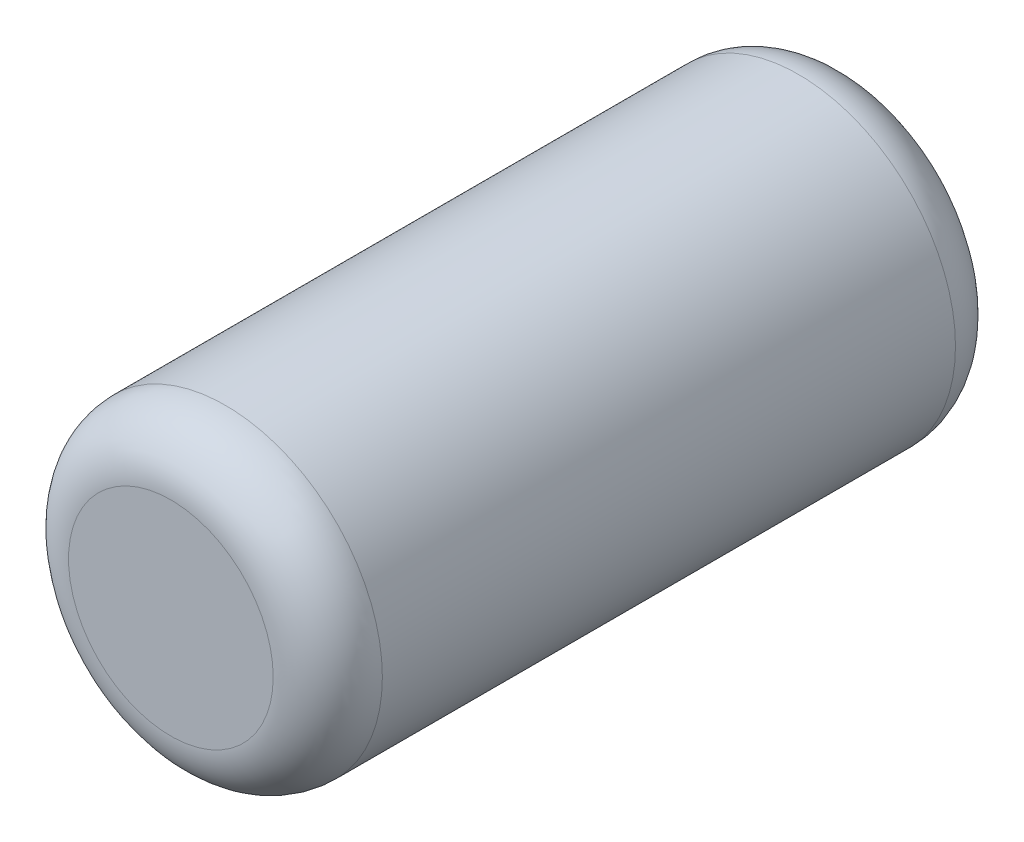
ISO-10303-21;
HEADER;
FILE_DESCRIPTION(('STEP AP214'),'2;1');
FILE_NAME('part.step','',(''),(''),'','','');
FILE_SCHEMA(('AUTOMOTIVE_DESIGN { 1 0 10303 214 1 1 1 1 }'));
ENDSEC;
DATA;
#1=APPLICATION_CONTEXT('core data for automotive mechanical design processes');
#2=APPLICATION_PROTOCOL_DEFINITION('international standard','automotive_design',2000,#1);
#3=PRODUCT_CONTEXT('',#1,'mechanical');
#4=PRODUCT('Part','Part','',(#3));
#5=PRODUCT_RELATED_PRODUCT_CATEGORY('part','',(#4));
#6=PRODUCT_DEFINITION_FORMATION('','',#4);
#7=PRODUCT_DEFINITION_CONTEXT('part definition',#1,'design');
#8=PRODUCT_DEFINITION('design','',#6,#7);
#9=PRODUCT_DEFINITION_SHAPE('','',#8);
#10=(LENGTH_UNIT() NAMED_UNIT(*) SI_UNIT(.MILLI.,.METRE.));
#11=(NAMED_UNIT(*) PLANE_ANGLE_UNIT() SI_UNIT($,.RADIAN.));
#12=(NAMED_UNIT(*) SI_UNIT($,.STERADIAN.) SOLID_ANGLE_UNIT());
#13=UNCERTAINTY_MEASURE_WITH_UNIT(LENGTH_MEASURE(1.E-05),#10,'distance_accuracy_value','');
#14=(GEOMETRIC_REPRESENTATION_CONTEXT(3) GLOBAL_UNCERTAINTY_ASSIGNED_CONTEXT((#13)) GLOBAL_UNIT_ASSIGNED_CONTEXT((#10,
#11,#12)) REPRESENTATION_CONTEXT('',''));
#15=CARTESIAN_POINT('',(0.,0.,0.));
#16=DIRECTION('',(0.,0.,1.));
#17=DIRECTION('',(1.,0.,0.));
#18=AXIS2_PLACEMENT_3D('',#15,#16,#17);
#19=CARTESIAN_POINT('',(0.,0.,1374.75198967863));
#20=DIRECTION('',(0.,0.,-1.));
#21=DIRECTION('',(-1.,0.,0.));
#22=AXIS2_PLACEMENT_3D('',#19,#20,#21);
#23=CYLINDRICAL_SURFACE('',#22,60.375);
#24=CARTESIAN_POINT('',(0.,0.,1353.75198967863));
#25=DIRECTION('',(0.,0.,1.));
#26=DIRECTION('',(1.,0.,0.));
#27=AXIS2_PLACEMENT_3D('',#24,#25,#26);
#28=CIRCLE('',#27,60.375);
#29=CARTESIAN_POINT('',(60.375,0.,1353.75198967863));
#30=VERTEX_POINT('',#29);
#31=EDGE_CURVE('E56',#30,#30,#28,.F.);
#32=ORIENTED_EDGE('',*,*,#31,.T.);
#33=EDGE_LOOP('',(#32));
#34=FACE_BOUND('',#33,.T.);
#35=CARTESIAN_POINT('',(0.,0.,1133.25198967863));
#36=DIRECTION('',(0.,0.,1.));
#37=DIRECTION('',(1.,0.,0.));
#38=AXIS2_PLACEMENT_3D('',#35,#36,#37);
#39=CIRCLE('',#38,60.375);
#40=CARTESIAN_POINT('',(60.375,0.,1133.25198967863));
#41=VERTEX_POINT('',#40);
#42=EDGE_CURVE('E61',#41,#41,#39,.T.);
#43=ORIENTED_EDGE('',*,*,#42,.T.);
#44=EDGE_LOOP('',(#43));
#45=FACE_BOUND('',#44,.T.);
#46=ADVANCED_FACE('F43',(#34,#45),#23,.T.);
#47=CARTESIAN_POINT('',(0.,0.,1374.75198967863));
#48=DIRECTION('',(0.,0.,1.));
#49=DIRECTION('',(1.,0.,0.));
#50=AXIS2_PLACEMENT_3D('',#47,#48,#49);
#51=PLANE('',#50);
#52=CARTESIAN_POINT('',(0.,0.,1374.75198967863));
#53=DIRECTION('',(0.,0.,1.));
#54=DIRECTION('',(1.,0.,0.));
#55=AXIS2_PLACEMENT_3D('',#52,#53,#54);
#56=CIRCLE('',#55,39.375);
#57=CARTESIAN_POINT('',(39.375,0.,1374.75198967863));
#58=VERTEX_POINT('',#57);
#59=EDGE_CURVE('E67',#58,#58,#56,.T.);
#60=ORIENTED_EDGE('',*,*,#59,.T.);
#61=EDGE_LOOP('',(#60));
#62=FACE_BOUND('',#61,.T.);
#63=ADVANCED_FACE('F86',(#62),#51,.T.);
#64=CARTESIAN_POINT('',(0.,0.,1112.25198967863));
#65=DIRECTION('',(0.,0.,1.));
#66=DIRECTION('',(1.,0.,0.));
#67=AXIS2_PLACEMENT_3D('',#64,#65,#66);
#68=PLANE('',#67);
#69=CARTESIAN_POINT('',(0.,0.,1112.25198967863));
#70=DIRECTION('',(0.,0.,1.));
#71=DIRECTION('',(1.,0.,0.));
#72=AXIS2_PLACEMENT_3D('',#69,#70,#71);
#73=CIRCLE('',#72,31.5);
#74=CARTESIAN_POINT('',(31.5,0.,1112.25198967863));
#75=VERTEX_POINT('',#74);
#76=EDGE_CURVE('E10',#75,#75,#73,.T.);
#77=ORIENTED_EDGE('',*,*,#76,.T.);
#78=EDGE_LOOP('',(#77));
#79=FACE_BOUND('',#78,.T.);
#80=CARTESIAN_POINT('',(0.,0.,1112.25198967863));
#81=DIRECTION('',(0.,0.,1.));
#82=DIRECTION('',(1.,0.,0.));
#83=AXIS2_PLACEMENT_3D('',#80,#81,#82);
#84=CIRCLE('',#83,39.375);
#85=CARTESIAN_POINT('',(39.375,0.,1112.25198967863));
#86=VERTEX_POINT('',#85);
#87=EDGE_CURVE('E51',#86,#86,#84,.F.);
#88=ORIENTED_EDGE('',*,*,#87,.T.);
#89=EDGE_LOOP('',(#88));
#90=FACE_BOUND('',#89,.T.);
#91=ADVANCED_FACE('F92',(#79,#90),#68,.F.);
#92=CARTESIAN_POINT('',(0.,0.,1353.75198967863));
#93=DIRECTION('',(0.,0.,1.));
#94=DIRECTION('',(1.,0.,0.));
#95=AXIS2_PLACEMENT_3D('',#92,#93,#94);
#96=TOROIDAL_SURFACE('',#95,39.375,21.);
#97=ORIENTED_EDGE('',*,*,#31,.F.);
#98=EDGE_LOOP('',(#97));
#99=FACE_BOUND('',#98,.T.);
#100=ORIENTED_EDGE('',*,*,#59,.F.);
#101=EDGE_LOOP('',(#100));
#102=FACE_BOUND('',#101,.T.);
#103=ADVANCED_FACE('F98',(#99,#102),#96,.T.);
#104=CARTESIAN_POINT('',(0.,0.,1133.25198967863));
#105=DIRECTION('',(0.,0.,1.));
#106=DIRECTION('',(1.,0.,0.));
#107=AXIS2_PLACEMENT_3D('',#104,#105,#106);
#108=TOROIDAL_SURFACE('',#107,39.375,21.);
#109=ORIENTED_EDGE('',*,*,#87,.F.);
#110=EDGE_LOOP('',(#109));
#111=FACE_BOUND('',#110,.T.);
#112=ORIENTED_EDGE('',*,*,#42,.F.);
#113=EDGE_LOOP('',(#112));
#114=FACE_BOUND('',#113,.T.);
#115=ADVANCED_FACE('F83',(#111,#114),#108,.T.);
#116=CARTESIAN_POINT('',(0.,0.,1091.25198967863));
#117=DIRECTION('',(0.,0.,-1.));
#118=DIRECTION('',(-1.,0.,0.));
#119=AXIS2_PLACEMENT_3D('',#116,#117,#118);
#120=PLANE('',#119);
#121=CARTESIAN_POINT('',(0.,0.,1091.25198967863));
#122=DIRECTION('',(0.,0.,-1.));
#123=DIRECTION('',(-1.,0.,0.));
#124=AXIS2_PLACEMENT_3D('',#121,#122,#123);
#125=CIRCLE('',#124,10.5);
#126=CARTESIAN_POINT('',(-10.5,0.,1091.25198967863));
#127=VERTEX_POINT('',#126);
#128=EDGE_CURVE('E71',#127,#127,#125,.T.);
#129=ORIENTED_EDGE('',*,*,#128,.T.);
#130=EDGE_LOOP('',(#129));
#131=FACE_BOUND('',#130,.T.);
#132=ADVANCED_FACE('F76',(#131),#120,.T.);
#133=CARTESIAN_POINT('',(0.,0.,1091.25198967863));
#134=DIRECTION('',(0.,0.,1.));
#135=DIRECTION('',(1.,0.,0.));
#136=AXIS2_PLACEMENT_3D('',#133,#134,#135);
#137=TOROIDAL_SURFACE('',#136,31.5,21.);
#138=ORIENTED_EDGE('',*,*,#76,.F.);
#139=EDGE_LOOP('',(#138));
#140=FACE_BOUND('',#139,.T.);
#141=ORIENTED_EDGE('',*,*,#128,.F.);
#142=EDGE_LOOP('',(#141));
#143=FACE_BOUND('',#142,.T.);
#144=ADVANCED_FACE('F45',(#140,#143),#137,.F.);
#145=CLOSED_SHELL('',(#46,#63,#91,#103,#115,#132,#144));
#146=MANIFOLD_SOLID_BREP('B2',#145);
#147=ADVANCED_BREP_SHAPE_REPRESENTATION('',(#18,#146),#14);
#148=SHAPE_DEFINITION_REPRESENTATION(#9,#147);
ENDSEC;
END-ISO-10303-21;
